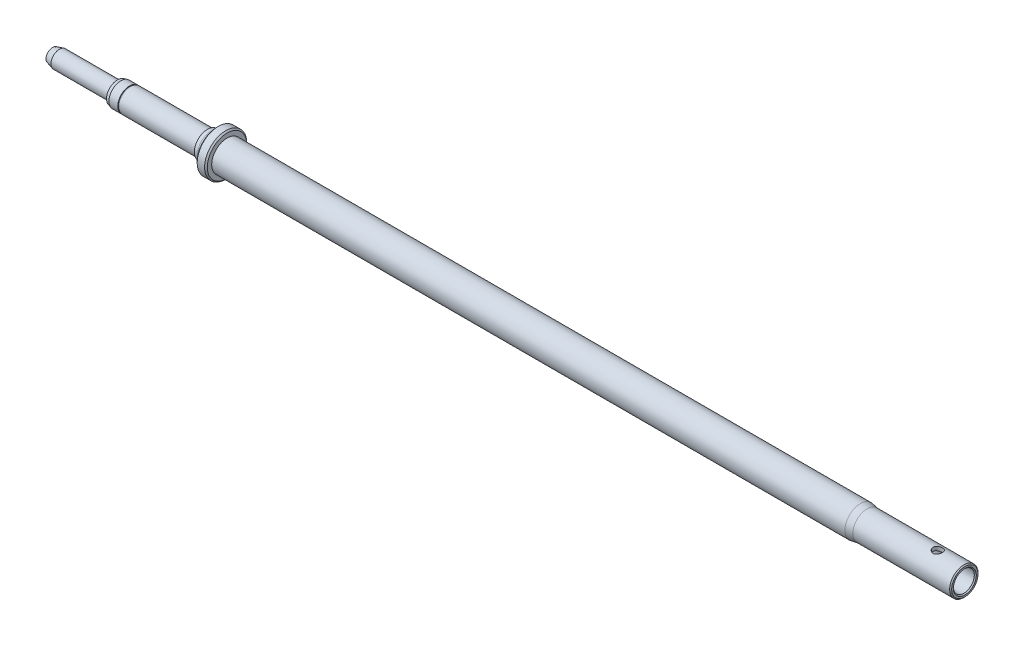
from build123d import *

# Parameters (mm, degrees)
ESQUISSE1_R             = 22.75
EXTRUSION1_DEPTH        = 963.5
ESQUISSE5_R             = 21
EXTRUSION3_DEPTH        = 145
CHANFREIN8_SIZE         = 1.5
ESQUISSE7_R             = 15.5
ENL_V_MAT_EXTRU_1_DEPTH = 1018
ESQUISSE17_R            = 7
ENL_V_MAT_EXTRU_5_DEPTH = 1109.966805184
CHANFREIN3_SIZE         = 1.5
ESQUISSE8_R             = 31.25
ESQUISSE8_R_2           = 22.75
EXTRUSION4_DEPTH        = 15
CHANFREIN6_SIZE         = 2
ESQUISSE18_R            = 19.5
EXTRUSION5_DEPTH        = 14
ESQUISSE19_R            = 17.5
EXTRUSION6_DEPTH        = 93
ESQUISSE20_R            = 17.5
EXTRUSION7_DEPTH        = 40.5
CHANFREIN10_SIZE        = 5
CHANFREIN10_SIZE2       = 1.339745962
ESQUISSE21_R            = 12.5
EXTRUSION8_DEPTH        = 96
CHANFREIN9_SIZE         = 10
CHANFREIN9_SIZE2        = 2.679491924
CONG_1_R                = 9
ESQUISSE23_R            = 7
ENL_V_MAT_EXTRU_6_DEPTH = 102
ESQUISSE24_R            = 7.75
ENL_V_MAT_EXTRU_7_DEPTH = 113
ESQUISSE25_R            = 9.75
ENL_V_MAT_EXTRU_8_DEPTH = 1138.858569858
ESQUISSE26_W            = 1.6
ESQUISSE26_H            = 1


with BuildPart() as part:
    # Esquisse1 → Extrusion1 (new body)
    with BuildSketch(Plane(origin=(0, 0, 0), x_dir=(0, 0, -1), z_dir=(1, 0, 0))):
        Circle(ESQUISSE1_R)
    extrude(amount=EXTRUSION1_DEPTH)

    # Esquisse5 → Extrusion3 (add)
    with BuildSketch(Plane(origin=(963.5, 0, 0), x_dir=(0, 0, -1), z_dir=(1, 0, 0))):
        Circle(ESQUISSE5_R)
    extrude(amount=EXTRUSION3_DEPTH)

    # Chanfrein8
    chanfrein8_edges = [part.edges().sort_by_distance(p)[0] for p in [
        (1108.5, 0, 21),
    ]]
    chamfer(chanfrein8_edges, length=CHANFREIN8_SIZE)

    # Esquisse16 → Enl_vement de mati_re-R_volution2 (revolve, cut)
    with BuildSketch(Plane.XY, mode=Mode.PRIVATE) as enl_vement_de_mati_re_r_volution2_sk:
        Polygon((963.5, 22.75), (953.5, 22.75), (963.5, 21), align=None)
    revolve(enl_vement_de_mati_re_r_volution2_sk.sketch.rotate(Axis((893.751479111, 0, 0), (1, 0, 0)), 90), axis=Axis((893.751479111, 0, 0), (1, 0, 0)), mode=Mode.SUBTRACT)

    # Esquisse7 → Enl_v. mat.-Extru.1 (cut)
    with BuildSketch(Plane(origin=(1108.5, 0, 0), x_dir=(0, 0, -1), z_dir=(1, 0, 0))):
        Circle(ESQUISSE7_R)
    extrude(amount=-ENL_V_MAT_EXTRU_1_DEPTH, mode=Mode.SUBTRACT)

    # Esquisse17 → Enl_v. mat.-Extru.5 (cut, through all)
    with BuildSketch(Plane(origin=(0, 0, 0), x_dir=(1, 0, 0), z_dir=(0, 1, 0))):
        with Locations(Location((1068.5, 0, 0), (0, 0, 90))):
            Circle(ESQUISSE17_R)
    extrude(amount=ENL_V_MAT_EXTRU_5_DEPTH, mode=Mode.SUBTRACT)

    # Chanfrein3
    chanfrein3_edges = [part.edges().sort_by_distance(p)[0] for p in [
        (1108.5, 0, 15.5),
    ]]
    chamfer(chanfrein3_edges, length=CHANFREIN3_SIZE)

    # Esquisse8 → Extrusion4 (add)
    with BuildSketch(Plane.ZY):
        Circle(ESQUISSE8_R)
        Circle(ESQUISSE8_R_2, mode=Mode.SUBTRACT)
    extrude(amount=-EXTRUSION4_DEPTH)

    # Chanfrein6
    chanfrein6_edges = [part.edges().sort_by_distance(p)[0] for p in [
        (15, 0, -31.25),
        (0, 0, -31.25),
    ]]
    chamfer(chanfrein6_edges, length=CHANFREIN6_SIZE)

    # Esquisse18 → Extrusion5 (add)
    with BuildSketch(Plane.ZY):
        with Locations(Location((0, 0, 0), (0, 0, 180))):
            Circle(ESQUISSE18_R)
    extrude(amount=EXTRUSION5_DEPTH)

    # Esquisse19 → Extrusion6 (add)
    with BuildSketch(Plane.ZY.offset(14)):
        Circle(ESQUISSE19_R)
    extrude(amount=EXTRUSION6_DEPTH)

    # Esquisse20 → Extrusion7 (add)
    with BuildSketch(Plane.ZY.offset(107)):
        Circle(ESQUISSE20_R)
    extrude(amount=EXTRUSION7_DEPTH)

    # Chanfrein10
    chanfrein10_edges = [part.edges().sort_by_distance(p)[0] for p in [
        (-147.5, 0, -17.5),
    ]]
    chanfrein10_side = [part.faces().sort_by_distance(p)[0] for p in [
        (-80.75, 0, -17.5),
    ]]
    chamfer(chanfrein10_edges, length=CHANFREIN10_SIZE, length2=CHANFREIN10_SIZE2, reference=chanfrein10_side[0])

    # Esquisse21 → Extrusion8 (add)
    with BuildSketch(Plane.ZY.offset(147.5)):
        Circle(ESQUISSE21_R)
    extrude(amount=EXTRUSION8_DEPTH)

    # Chanfrein9
    chanfrein9_edges = [part.edges().sort_by_distance(p)[0] for p in [
        (-243.5, 0, -12.5),
    ]]
    chanfrein9_side = [part.faces().sort_by_distance(p)[0] for p in [
        (-195.5, 0, -12.5),
    ]]
    chamfer(chanfrein9_edges, length=CHANFREIN9_SIZE, length2=CHANFREIN9_SIZE2, reference=chanfrein9_side[0])

    # Cong_1
    cong_1_edges = [part.edges().sort_by_distance(p)[0] for p in [
        (0, 0, 19.5),
    ]]
    fillet(cong_1_edges, radius=CONG_1_R)

    # Esquisse23 → Enl_v. mat.-Extru.6 (cut)
    with BuildSketch(Plane.ZY.offset(243.5)):
        Circle(ESQUISSE23_R)
    extrude(amount=-ENL_V_MAT_EXTRU_6_DEPTH, mode=Mode.SUBTRACT)

    # Esquisse24 → Enl_v. mat.-Extru.7 (cut)
    with BuildSketch(Plane.ZY.offset(141.5)):
        Circle(ESQUISSE24_R)
    extrude(amount=-ENL_V_MAT_EXTRU_7_DEPTH, mode=Mode.SUBTRACT)

    # Esquisse25 → Enl_v. mat.-Extru.8 (cut, through all)
    with BuildSketch(Plane.ZY.offset(28.5)):
        Circle(ESQUISSE25_R)
    extrude(amount=-ENL_V_MAT_EXTRU_8_DEPTH, mode=Mode.SUBTRACT)

    # Esquisse26 → Enl_vement de mati_re-R_volution3 (revolve, cut)
    with BuildSketch(Plane.XY, mode=Mode.PRIVATE) as enl_vement_de_mati_re_r_volution3_sk:
        with Locations((-128.7, 17)):
            Rectangle(ESQUISSE26_W, ESQUISSE26_H)
    revolve(enl_vement_de_mati_re_r_volution3_sk.sketch.rotate(Axis((-136.231869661, 0, 0), (1, 0, 0)), 90), axis=Axis((-136.231869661, 0, 0), (1, 0, 0)), mode=Mode.SUBTRACT)


solid = part.part
